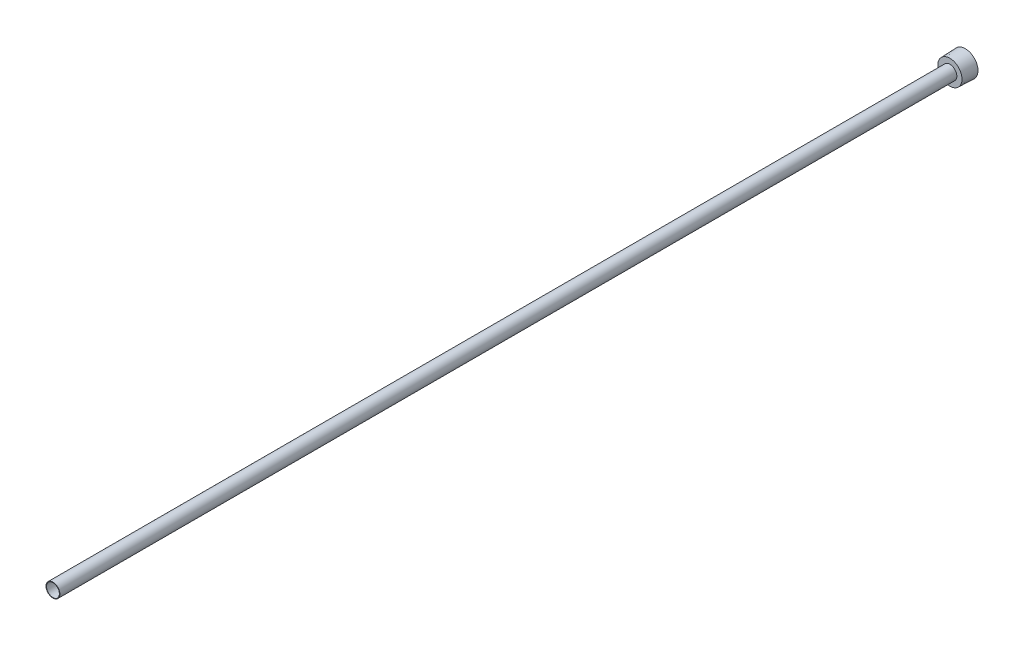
ISO-10303-21;
HEADER;
FILE_DESCRIPTION(('STEP AP214'),'2;1');
FILE_NAME('part.step','',(''),(''),'','','');
FILE_SCHEMA(('AUTOMOTIVE_DESIGN { 1 0 10303 214 1 1 1 1 }'));
ENDSEC;
DATA;
#1=APPLICATION_CONTEXT('core data for automotive mechanical design processes');
#2=APPLICATION_PROTOCOL_DEFINITION('international standard','automotive_design',2000,#1);
#3=PRODUCT_CONTEXT('',#1,'mechanical');
#4=PRODUCT('Part','Part','',(#3));
#5=PRODUCT_RELATED_PRODUCT_CATEGORY('part','',(#4));
#6=PRODUCT_DEFINITION_FORMATION('','',#4);
#7=PRODUCT_DEFINITION_CONTEXT('part definition',#1,'design');
#8=PRODUCT_DEFINITION('design','',#6,#7);
#9=PRODUCT_DEFINITION_SHAPE('','',#8);
#10=(LENGTH_UNIT() NAMED_UNIT(*) SI_UNIT(.MILLI.,.METRE.));
#11=(NAMED_UNIT(*) PLANE_ANGLE_UNIT() SI_UNIT($,.RADIAN.));
#12=(NAMED_UNIT(*) SI_UNIT($,.STERADIAN.) SOLID_ANGLE_UNIT());
#13=UNCERTAINTY_MEASURE_WITH_UNIT(LENGTH_MEASURE(1.E-05),#10,'distance_accuracy_value','');
#14=(GEOMETRIC_REPRESENTATION_CONTEXT(3) GLOBAL_UNCERTAINTY_ASSIGNED_CONTEXT((#13)) GLOBAL_UNIT_ASSIGNED_CONTEXT((#10,
#11,#12)) REPRESENTATION_CONTEXT('',''));
#15=CARTESIAN_POINT('',(0.,0.,0.));
#16=DIRECTION('',(0.,0.,1.));
#17=DIRECTION('',(1.,0.,0.));
#18=AXIS2_PLACEMENT_3D('',#15,#16,#17);
#19=CARTESIAN_POINT('',(0.,0.,0.));
#20=DIRECTION('',(0.,0.,1.));
#21=DIRECTION('',(1.,0.,0.));
#22=AXIS2_PLACEMENT_3D('',#19,#20,#21);
#23=CYLINDRICAL_SURFACE('',#22,4.318);
#24=CARTESIAN_POINT('',(0.,0.,609.6));
#25=DIRECTION('',(0.,0.,1.));
#26=DIRECTION('',(1.,0.,0.));
#27=AXIS2_PLACEMENT_3D('',#24,#25,#26);
#28=CIRCLE('',#27,4.318);
#29=CARTESIAN_POINT('',(4.318,0.,609.6));
#30=VERTEX_POINT('',#29);
#31=EDGE_CURVE('E142',#30,#30,#28,.T.);
#32=CARTESIAN_POINT('',(0.,0.,6.35));
#33=DIRECTION('',(0.,0.,-1.));
#34=DIRECTION('',(-1.,0.,0.));
#35=AXIS2_PLACEMENT_3D('',#32,#33,#34);
#36=CIRCLE('',#35,4.318);
#37=CARTESIAN_POINT('',(4.318,0.,6.35));
#38=VERTEX_POINT('',#37);
#39=EDGE_CURVE('E37',#38,#38,#36,.F.);
#40=CARTESIAN_POINT('',(4.318,0.,609.6));
#41=CARTESIAN_POINT('',(4.318,0.,603.316145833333));
#42=CARTESIAN_POINT('',(4.318,0.,597.032291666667));
#43=CARTESIAN_POINT('',(4.318,0.,584.464583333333));
#44=CARTESIAN_POINT('',(4.318,0.,578.180729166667));
#45=CARTESIAN_POINT('',(4.318,0.,565.613020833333));
#46=CARTESIAN_POINT('',(4.318,0.,559.329166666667));
#47=CARTESIAN_POINT('',(4.318,0.,546.761458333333));
#48=CARTESIAN_POINT('',(4.318,0.,540.477604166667));
#49=CARTESIAN_POINT('',(4.318,0.,527.909895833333));
#50=CARTESIAN_POINT('',(4.318,0.,521.626041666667));
#51=CARTESIAN_POINT('',(4.318,0.,509.058333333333));
#52=CARTESIAN_POINT('',(4.318,0.,502.774479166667));
#53=CARTESIAN_POINT('',(4.318,0.,490.206770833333));
#54=CARTESIAN_POINT('',(4.318,0.,483.922916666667));
#55=CARTESIAN_POINT('',(4.318,0.,471.355208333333));
#56=CARTESIAN_POINT('',(4.318,0.,465.071354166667));
#57=CARTESIAN_POINT('',(4.318,0.,452.503645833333));
#58=CARTESIAN_POINT('',(4.318,0.,446.219791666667));
#59=CARTESIAN_POINT('',(4.318,0.,433.652083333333));
#60=CARTESIAN_POINT('',(4.318,0.,427.368229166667));
#61=CARTESIAN_POINT('',(4.318,0.,414.800520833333));
#62=CARTESIAN_POINT('',(4.318,0.,408.516666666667));
#63=CARTESIAN_POINT('',(4.318,0.,395.948958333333));
#64=CARTESIAN_POINT('',(4.318,0.,389.665104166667));
#65=CARTESIAN_POINT('',(4.318,0.,377.097395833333));
#66=CARTESIAN_POINT('',(4.318,0.,370.813541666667));
#67=CARTESIAN_POINT('',(4.318,0.,358.245833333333));
#68=CARTESIAN_POINT('',(4.318,0.,351.961979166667));
#69=CARTESIAN_POINT('',(4.318,0.,339.394270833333));
#70=CARTESIAN_POINT('',(4.318,0.,333.110416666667));
#71=CARTESIAN_POINT('',(4.318,0.,320.542708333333));
#72=CARTESIAN_POINT('',(4.318,0.,314.258854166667));
#73=CARTESIAN_POINT('',(4.318,0.,301.691145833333));
#74=CARTESIAN_POINT('',(4.318,0.,295.407291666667));
#75=CARTESIAN_POINT('',(4.318,0.,282.839583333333));
#76=CARTESIAN_POINT('',(4.318,0.,276.555729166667));
#77=CARTESIAN_POINT('',(4.318,0.,263.988020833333));
#78=CARTESIAN_POINT('',(4.318,0.,257.704166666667));
#79=CARTESIAN_POINT('',(4.318,0.,245.136458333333));
#80=CARTESIAN_POINT('',(4.318,0.,238.852604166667));
#81=CARTESIAN_POINT('',(4.318,0.,226.284895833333));
#82=CARTESIAN_POINT('',(4.318,0.,220.001041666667));
#83=CARTESIAN_POINT('',(4.318,0.,207.433333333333));
#84=CARTESIAN_POINT('',(4.318,0.,201.149479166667));
#85=CARTESIAN_POINT('',(4.318,0.,188.581770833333));
#86=CARTESIAN_POINT('',(4.318,0.,182.297916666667));
#87=CARTESIAN_POINT('',(4.318,0.,169.730208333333));
#88=CARTESIAN_POINT('',(4.318,0.,163.446354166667));
#89=CARTESIAN_POINT('',(4.318,0.,150.878645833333));
#90=CARTESIAN_POINT('',(4.318,0.,144.594791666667));
#91=CARTESIAN_POINT('',(4.318,0.,132.027083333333));
#92=CARTESIAN_POINT('',(4.318,0.,125.743229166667));
#93=CARTESIAN_POINT('',(4.318,0.,113.175520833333));
#94=CARTESIAN_POINT('',(4.318,0.,106.891666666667));
#95=CARTESIAN_POINT('',(4.318,0.,94.3239583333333));
#96=CARTESIAN_POINT('',(4.318,0.,88.0401041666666));
#97=CARTESIAN_POINT('',(4.318,0.,75.4723958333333));
#98=CARTESIAN_POINT('',(4.318,0.,69.1885416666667));
#99=CARTESIAN_POINT('',(4.318,0.,56.6208333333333));
#100=CARTESIAN_POINT('',(4.318,0.,50.3369791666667));
#101=CARTESIAN_POINT('',(4.318,0.,37.7692708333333));
#102=CARTESIAN_POINT('',(4.318,0.,31.4854166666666));
#103=CARTESIAN_POINT('',(4.318,0.,18.9177083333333));
#104=CARTESIAN_POINT('',(4.318,0.,12.6338541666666));
#105=CARTESIAN_POINT('',(4.318,0.,6.34999999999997));
#106=B_SPLINE_CURVE_WITH_KNOTS('',3,(#40,#41,#42,#43,#44,#45,#46,#47,#48,#49,#50,#51,#52,#53,
#54,#55,#56,#57,#58,#59,#60,#61,#62,#63,#64,#65,#66,#67,#68,#69,#70,#71,#72,#73,#74,#75,#76,#77,
#78,#79,#80,#81,#82,#83,#84,#85,#86,#87,#88,#89,#90,#91,#92,#93,#94,#95,#96,#97,#98,#99,#100,
#101,#102,#103,#104,#105),.UNSPECIFIED.,.F.,.F.,(4,2,2,2,2,2,2,2,2,2,2,2,2,2,2,2,2,2,2,2,2,2,2,
2,2,2,2,2,2,2,2,2,4),(0.,18.8515625,37.7031250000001,56.5546875,75.40625,94.2578125,113.109375,
131.9609375,150.8125,169.6640625,188.515625,207.3671875,226.21875,245.0703125,263.921875,
282.7734375,301.625,320.4765625,339.328125,358.1796875,377.03125,395.8828125,414.734375,
433.5859375,452.4375,471.2890625,490.140625,508.9921875,527.84375,546.6953125,565.546875,
584.3984375,603.25),.UNSPECIFIED.);
#107=EDGE_CURVE('BSEAM33',#30,#38,#106,.T.);
#108=ORIENTED_EDGE('',*,*,#31,.T.);
#109=ORIENTED_EDGE('',*,*,#39,.F.);
#110=ORIENTED_EDGE('',*,*,#107,.T.);
#111=ORIENTED_EDGE('',*,*,#107,.F.);
#112=EDGE_LOOP('',(#108,#110,#109,#111));
#113=FACE_BOUND('',#112,.T.);
#114=ADVANCED_FACE('F33',(#113),#23,.F.);
#115=CARTESIAN_POINT('',(0.,0.,0.));
#116=DIRECTION('',(0.,0.,-1.));
#117=DIRECTION('',(-1.,0.,0.));
#118=AXIS2_PLACEMENT_3D('',#115,#116,#117);
#119=CONICAL_SURFACE('',#118,8.4709,0.0364599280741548);
#120=CARTESIAN_POINT('',(0.,0.,10.3124));
#121=DIRECTION('',(0.,0.,1.));
#122=DIRECTION('',(1.,0.,0.));
#123=AXIS2_PLACEMENT_3D('',#120,#121,#122);
#124=CIRCLE('',#123,8.09474394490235);
#125=CARTESIAN_POINT('',(8.09474394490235,0.,10.3124));
#126=VERTEX_POINT('',#125);
#127=EDGE_CURVE('E11',#126,#126,#124,.T.);
#128=ORIENTED_EDGE('',*,*,#127,.F.);
#129=EDGE_LOOP('',(#128));
#130=FACE_BOUND('',#129,.T.);
#131=CARTESIAN_POINT('',(0.,0.,0.));
#132=DIRECTION('',(0.,0.,1.));
#133=DIRECTION('',(1.,0.,0.));
#134=AXIS2_PLACEMENT_3D('',#131,#132,#133);
#135=CIRCLE('',#134,8.4709);
#136=CARTESIAN_POINT('',(8.4709,0.,0.));
#137=VERTEX_POINT('',#136);
#138=EDGE_CURVE('E145',#137,#137,#135,.T.);
#139=ORIENTED_EDGE('',*,*,#138,.T.);
#140=EDGE_LOOP('',(#139));
#141=FACE_BOUND('',#140,.T.);
#142=ADVANCED_FACE('F35',(#130,#141),#119,.T.);
#143=CARTESIAN_POINT('',(0.,8.09474394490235,10.3124));
#144=DIRECTION('',(0.,0.,-1.));
#145=DIRECTION('',(-1.,0.,0.));
#146=AXIS2_PLACEMENT_3D('',#143,#144,#145);
#147=PLANE('',#146);
#148=CARTESIAN_POINT('',(0.,0.,10.3124));
#149=DIRECTION('',(0.,0.,1.));
#150=DIRECTION('',(1.,0.,0.));
#151=AXIS2_PLACEMENT_3D('',#148,#149,#150);
#152=CIRCLE('',#151,4.6355);
#153=CARTESIAN_POINT('',(4.6355,0.,10.3124));
#154=VERTEX_POINT('',#153);
#155=EDGE_CURVE('E42',#154,#154,#152,.T.);
#156=ORIENTED_EDGE('',*,*,#155,.F.);
#157=EDGE_LOOP('',(#156));
#158=FACE_BOUND('',#157,.T.);
#159=ORIENTED_EDGE('',*,*,#127,.T.);
#160=EDGE_LOOP('',(#159));
#161=FACE_BOUND('',#160,.T.);
#162=ADVANCED_FACE('F156',(#158,#161),#147,.F.);
#163=CARTESIAN_POINT('',(0.,0.,168.793426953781));
#164=DIRECTION('',(0.,0.,1.));
#165=DIRECTION('',(1.,0.,0.));
#166=AXIS2_PLACEMENT_3D('',#163,#164,#165);
#167=CYLINDRICAL_SURFACE('',#166,4.63549999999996);
#168=CARTESIAN_POINT('',(0.,0.,609.6));
#169=DIRECTION('',(0.,0.,1.));
#170=DIRECTION('',(1.,0.,0.));
#171=AXIS2_PLACEMENT_3D('',#168,#169,#170);
#172=CIRCLE('',#171,4.63549999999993);
#173=CARTESIAN_POINT('',(4.63549999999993,0.,609.6));
#174=VERTEX_POINT('',#173);
#175=EDGE_CURVE('E148',#174,#174,#172,.T.);
#176=ORIENTED_EDGE('',*,*,#175,.F.);
#177=EDGE_LOOP('',(#176));
#178=FACE_BOUND('',#177,.T.);
#179=ORIENTED_EDGE('',*,*,#155,.T.);
#180=EDGE_LOOP('',(#179));
#181=FACE_BOUND('',#180,.T.);
#182=ADVANCED_FACE('F154',(#178,#181),#167,.T.);
#183=CARTESIAN_POINT('',(0.,4.63549999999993,609.6));
#184=DIRECTION('',(0.,0.,-1.));
#185=DIRECTION('',(-1.,0.,0.));
#186=AXIS2_PLACEMENT_3D('',#183,#184,#185);
#187=PLANE('',#186);
#188=ORIENTED_EDGE('',*,*,#31,.F.);
#189=EDGE_LOOP('',(#188));
#190=FACE_BOUND('',#189,.T.);
#191=ORIENTED_EDGE('',*,*,#175,.T.);
#192=EDGE_LOOP('',(#191));
#193=FACE_BOUND('',#192,.T.);
#194=ADVANCED_FACE('F167',(#190,#193),#187,.F.);
#195=CARTESIAN_POINT('',(0.,0.,0.));
#196=DIRECTION('',(0.,0.,1.));
#197=DIRECTION('',(1.,0.,0.));
#198=AXIS2_PLACEMENT_3D('',#195,#196,#197);
#199=PLANE('',#198);
#200=DIRECTION('',(-0.866025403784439,-0.5,0.));
#201=VECTOR('',#200,1.);
#202=CARTESIAN_POINT('',(4.7625,-2.74963065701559,0.));
#203=LINE('',#202,#201);
#204=CARTESIAN_POINT('',(4.7625,-2.74963065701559,0.));
#205=VERTEX_POINT('',#204);
#206=CARTESIAN_POINT('',(0.,-5.49926131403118,0.));
#207=VERTEX_POINT('',#206);
#208=EDGE_CURVE('E124',#205,#207,#203,.T.);
#209=ORIENTED_EDGE('',*,*,#208,.F.);
#210=DIRECTION('',(0.,-1.,0.));
#211=VECTOR('',#210,1.);
#212=CARTESIAN_POINT('',(4.7625,2.74963065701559,0.));
#213=LINE('',#212,#211);
#214=CARTESIAN_POINT('',(4.7625,2.74963065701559,0.));
#215=VERTEX_POINT('',#214);
#216=EDGE_CURVE('E49',#215,#205,#213,.T.);
#217=ORIENTED_EDGE('',*,*,#216,.F.);
#218=DIRECTION('',(0.866025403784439,-0.5,0.));
#219=VECTOR('',#218,1.);
#220=CARTESIAN_POINT('',(0.,5.49926131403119,0.));
#221=LINE('',#220,#219);
#222=CARTESIAN_POINT('',(0.,5.49926131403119,0.));
#223=VERTEX_POINT('',#222);
#224=EDGE_CURVE('E133',#223,#215,#221,.T.);
#225=ORIENTED_EDGE('',*,*,#224,.F.);
#226=DIRECTION('',(0.866025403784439,0.5,0.));
#227=VECTOR('',#226,1.);
#228=CARTESIAN_POINT('',(-4.7625,2.7496306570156,0.));
#229=LINE('',#228,#227);
#230=CARTESIAN_POINT('',(-4.7625,2.7496306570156,0.));
#231=VERTEX_POINT('',#230);
#232=EDGE_CURVE('E131',#231,#223,#229,.T.);
#233=ORIENTED_EDGE('',*,*,#232,.F.);
#234=DIRECTION('',(0.,1.,0.));
#235=VECTOR('',#234,1.);
#236=CARTESIAN_POINT('',(-4.7625,-2.74963065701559,0.));
#237=LINE('',#236,#235);
#238=CARTESIAN_POINT('',(-4.7625,-2.74963065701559,0.));
#239=VERTEX_POINT('',#238);
#240=EDGE_CURVE('E97',#239,#231,#237,.T.);
#241=ORIENTED_EDGE('',*,*,#240,.F.);
#242=DIRECTION('',(-0.866025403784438,0.5,0.));
#243=VECTOR('',#242,1.);
#244=CARTESIAN_POINT('',(0.,-5.49926131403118,0.));
#245=LINE('',#244,#243);
#246=EDGE_CURVE('E127',#207,#239,#245,.T.);
#247=ORIENTED_EDGE('',*,*,#246,.F.);
#248=EDGE_LOOP('',(#209,#217,#225,#233,#241,#247));
#249=FACE_BOUND('',#248,.T.);
#250=ORIENTED_EDGE('',*,*,#138,.F.);
#251=EDGE_LOOP('',(#250));
#252=FACE_BOUND('',#251,.T.);
#253=ADVANCED_FACE('F165',(#249,#252),#199,.F.);
#254=CARTESIAN_POINT('',(4.7625,-2.74963065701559,6.35));
#255=DIRECTION('',(0.,0.,-1.));
#256=DIRECTION('',(-1.,0.,0.));
#257=AXIS2_PLACEMENT_3D('',#254,#255,#256);
#258=PLANE('',#257);
#259=DIRECTION('',(0.,-1.,0.));
#260=VECTOR('',#259,1.);
#261=CARTESIAN_POINT('',(4.7625,2.74963065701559,6.35));
#262=LINE('',#261,#260);
#263=CARTESIAN_POINT('',(4.7625,2.74963065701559,6.35));
#264=VERTEX_POINT('',#263);
#265=CARTESIAN_POINT('',(4.7625,-2.74963065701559,6.35));
#266=VERTEX_POINT('',#265);
#267=EDGE_CURVE('E135',#264,#266,#262,.T.);
#268=ORIENTED_EDGE('',*,*,#267,.T.);
#269=DIRECTION('',(-0.866025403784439,-0.5,0.));
#270=VECTOR('',#269,1.);
#271=CARTESIAN_POINT('',(4.7625,-2.74963065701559,6.35));
#272=LINE('',#271,#270);
#273=CARTESIAN_POINT('',(0.,-5.49926131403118,6.35));
#274=VERTEX_POINT('',#273);
#275=EDGE_CURVE('E118',#266,#274,#272,.T.);
#276=ORIENTED_EDGE('',*,*,#275,.T.);
#277=DIRECTION('',(-0.866025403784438,0.5,0.));
#278=VECTOR('',#277,1.);
#279=CARTESIAN_POINT('',(0.,-5.49926131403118,6.35));
#280=LINE('',#279,#278);
#281=CARTESIAN_POINT('',(-4.7625,-2.74963065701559,6.35));
#282=VERTEX_POINT('',#281);
#283=EDGE_CURVE('E116',#274,#282,#280,.T.);
#284=ORIENTED_EDGE('',*,*,#283,.T.);
#285=DIRECTION('',(0.,1.,0.));
#286=VECTOR('',#285,1.);
#287=CARTESIAN_POINT('',(-4.7625,-2.74963065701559,6.35));
#288=LINE('',#287,#286);
#289=CARTESIAN_POINT('',(-4.7625,2.7496306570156,6.35));
#290=VERTEX_POINT('',#289);
#291=EDGE_CURVE('E94',#282,#290,#288,.T.);
#292=ORIENTED_EDGE('',*,*,#291,.T.);
#293=DIRECTION('',(0.866025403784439,0.5,0.));
#294=VECTOR('',#293,1.);
#295=CARTESIAN_POINT('',(-4.7625,2.7496306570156,6.35));
#296=LINE('',#295,#294);
#297=CARTESIAN_POINT('',(0.,5.49926131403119,6.35));
#298=VERTEX_POINT('',#297);
#299=EDGE_CURVE('E105',#290,#298,#296,.T.);
#300=ORIENTED_EDGE('',*,*,#299,.T.);
#301=DIRECTION('',(0.866025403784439,-0.5,0.));
#302=VECTOR('',#301,1.);
#303=CARTESIAN_POINT('',(0.,5.49926131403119,6.35));
#304=LINE('',#303,#302);
#305=EDGE_CURVE('E109',#298,#264,#304,.T.);
#306=ORIENTED_EDGE('',*,*,#305,.T.);
#307=EDGE_LOOP('',(#268,#276,#284,#292,#300,#306));
#308=FACE_BOUND('',#307,.T.);
#309=ORIENTED_EDGE('',*,*,#39,.T.);
#310=EDGE_LOOP('',(#309));
#311=FACE_BOUND('',#310,.T.);
#312=ADVANCED_FACE('F112',(#308,#311),#258,.T.);
#313=CARTESIAN_POINT('',(4.7625,2.74963065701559,6.35));
#314=DIRECTION('',(1.,0.,0.));
#315=DIRECTION('',(0.,0.,-1.));
#316=AXIS2_PLACEMENT_3D('',#313,#314,#315);
#317=PLANE('',#316);
#318=ORIENTED_EDGE('',*,*,#216,.T.);
#319=DIRECTION('',(0.,0.,-1.));
#320=VECTOR('',#319,1.);
#321=CARTESIAN_POINT('',(4.7625,-2.74963065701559,6.35));
#322=LINE('',#321,#320);
#323=EDGE_CURVE('E79',#266,#205,#322,.T.);
#324=ORIENTED_EDGE('',*,*,#323,.F.);
#325=ORIENTED_EDGE('',*,*,#267,.F.);
#326=DIRECTION('',(0.,0.,-1.));
#327=VECTOR('',#326,1.);
#328=CARTESIAN_POINT('',(4.7625,2.74963065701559,6.35));
#329=LINE('',#328,#327);
#330=EDGE_CURVE('E57',#264,#215,#329,.T.);
#331=ORIENTED_EDGE('',*,*,#330,.T.);
#332=EDGE_LOOP('',(#318,#324,#325,#331));
#333=FACE_BOUND('',#332,.T.);
#334=ADVANCED_FACE('F174',(#333),#317,.F.);
#335=CARTESIAN_POINT('',(0.,5.49926131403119,6.35));
#336=DIRECTION('',(0.5,0.866025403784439,0.));
#337=DIRECTION('',(-0.866025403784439,0.5,0.));
#338=AXIS2_PLACEMENT_3D('',#335,#336,#337);
#339=PLANE('',#338);
#340=ORIENTED_EDGE('',*,*,#224,.T.);
#341=ORIENTED_EDGE('',*,*,#330,.F.);
#342=ORIENTED_EDGE('',*,*,#305,.F.);
#343=DIRECTION('',(0.,0.,-1.));
#344=VECTOR('',#343,1.);
#345=CARTESIAN_POINT('',(0.,5.49926131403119,6.35));
#346=LINE('',#345,#344);
#347=EDGE_CURVE('E101',#298,#223,#346,.T.);
#348=ORIENTED_EDGE('',*,*,#347,.T.);
#349=EDGE_LOOP('',(#340,#341,#342,#348));
#350=FACE_BOUND('',#349,.T.);
#351=ADVANCED_FACE('F188',(#350),#339,.F.);
#352=CARTESIAN_POINT('',(-4.7625,2.7496306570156,6.35));
#353=DIRECTION('',(-0.5,0.866025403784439,0.));
#354=DIRECTION('',(-0.866025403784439,-0.5,0.));
#355=AXIS2_PLACEMENT_3D('',#352,#353,#354);
#356=PLANE('',#355);
#357=ORIENTED_EDGE('',*,*,#232,.T.);
#358=ORIENTED_EDGE('',*,*,#347,.F.);
#359=ORIENTED_EDGE('',*,*,#299,.F.);
#360=DIRECTION('',(0.,0.,-1.));
#361=VECTOR('',#360,1.);
#362=CARTESIAN_POINT('',(-4.7625,2.7496306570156,6.35));
#363=LINE('',#362,#361);
#364=EDGE_CURVE('E90',#290,#231,#363,.T.);
#365=ORIENTED_EDGE('',*,*,#364,.T.);
#366=EDGE_LOOP('',(#357,#358,#359,#365));
#367=FACE_BOUND('',#366,.T.);
#368=ADVANCED_FACE('F106',(#367),#356,.F.);
#369=CARTESIAN_POINT('',(-4.7625,-2.74963065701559,6.35));
#370=DIRECTION('',(-1.,0.,0.));
#371=DIRECTION('',(0.,-1.,0.));
#372=AXIS2_PLACEMENT_3D('',#369,#370,#371);
#373=PLANE('',#372);
#374=ORIENTED_EDGE('',*,*,#240,.T.);
#375=ORIENTED_EDGE('',*,*,#364,.F.);
#376=ORIENTED_EDGE('',*,*,#291,.F.);
#377=DIRECTION('',(0.,0.,-1.));
#378=VECTOR('',#377,1.);
#379=CARTESIAN_POINT('',(-4.7625,-2.74963065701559,6.35));
#380=LINE('',#379,#378);
#381=EDGE_CURVE('E102',#282,#239,#380,.T.);
#382=ORIENTED_EDGE('',*,*,#381,.T.);
#383=EDGE_LOOP('',(#374,#375,#376,#382));
#384=FACE_BOUND('',#383,.T.);
#385=ADVANCED_FACE('F92',(#384),#373,.F.);
#386=CARTESIAN_POINT('',(0.,-5.49926131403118,6.35));
#387=DIRECTION('',(-0.5,-0.866025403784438,0.));
#388=DIRECTION('',(0.866025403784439,-0.5,0.));
#389=AXIS2_PLACEMENT_3D('',#386,#387,#388);
#390=PLANE('',#389);
#391=ORIENTED_EDGE('',*,*,#246,.T.);
#392=ORIENTED_EDGE('',*,*,#381,.F.);
#393=ORIENTED_EDGE('',*,*,#283,.F.);
#394=DIRECTION('',(0.,0.,-1.));
#395=VECTOR('',#394,1.);
#396=CARTESIAN_POINT('',(0.,-5.49926131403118,6.35));
#397=LINE('',#396,#395);
#398=EDGE_CURVE('E139',#274,#207,#397,.T.);
#399=ORIENTED_EDGE('',*,*,#398,.T.);
#400=EDGE_LOOP('',(#391,#392,#393,#399));
#401=FACE_BOUND('',#400,.T.);
#402=ADVANCED_FACE('F192',(#401),#390,.F.);
#403=CARTESIAN_POINT('',(4.7625,-2.74963065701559,6.35));
#404=DIRECTION('',(0.5,-0.866025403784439,0.));
#405=DIRECTION('',(0.866025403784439,0.5,0.));
#406=AXIS2_PLACEMENT_3D('',#403,#404,#405);
#407=PLANE('',#406);
#408=ORIENTED_EDGE('',*,*,#208,.T.);
#409=ORIENTED_EDGE('',*,*,#398,.F.);
#410=ORIENTED_EDGE('',*,*,#275,.F.);
#411=ORIENTED_EDGE('',*,*,#323,.T.);
#412=EDGE_LOOP('',(#408,#409,#410,#411));
#413=FACE_BOUND('',#412,.T.);
#414=ADVANCED_FACE('F189',(#413),#407,.F.);
#415=CLOSED_SHELL('',(#114,#142,#162,#182,#194,#253,#312,#334,#351,#368,#385,#402,#414));
#416=MANIFOLD_SOLID_BREP('B2',#415);
#417=ADVANCED_BREP_SHAPE_REPRESENTATION('',(#18,#416),#14);
#418=SHAPE_DEFINITION_REPRESENTATION(#9,#417);
ENDSEC;
END-ISO-10303-21;
